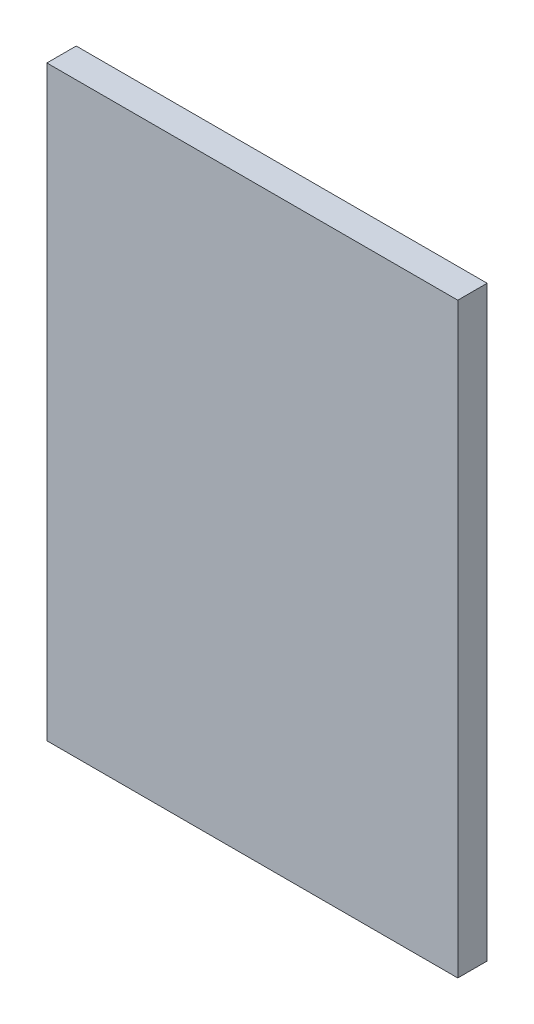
from build123d import *

# Parameters (mm, degrees)
SKIZZE1_W               = 140
SKIZZE1_H               = 200
LINEAR_AUSTRAGEN1_DEPTH = 10


with BuildPart() as part:
    # Skizze1 → Linear austragen1 (new body)
    with BuildSketch(Plane.XY):
        with Locations((0, 100)):
            Rectangle(SKIZZE1_W, SKIZZE1_H)
    extrude(amount=LINEAR_AUSTRAGEN1_DEPTH)


solid = part.part
